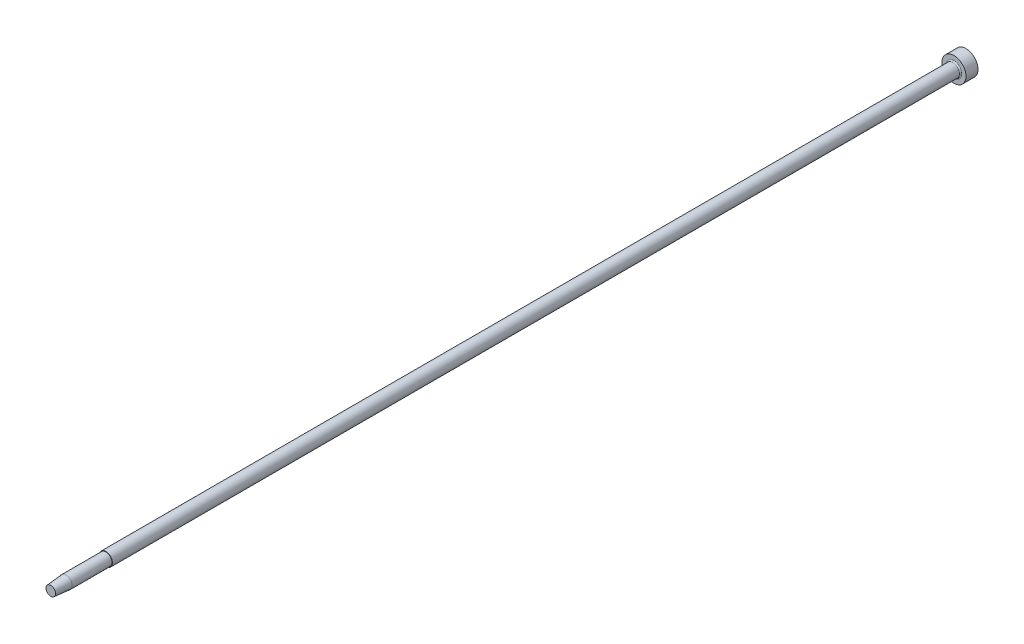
ISO-10303-21;
HEADER;
FILE_DESCRIPTION(('STEP AP214'),'2;1');
FILE_NAME('part.step','',(''),(''),'','','');
FILE_SCHEMA(('AUTOMOTIVE_DESIGN { 1 0 10303 214 1 1 1 1 }'));
ENDSEC;
DATA;
#1=APPLICATION_CONTEXT('core data for automotive mechanical design processes');
#2=APPLICATION_PROTOCOL_DEFINITION('international standard','automotive_design',2000,#1);
#3=PRODUCT_CONTEXT('',#1,'mechanical');
#4=PRODUCT('Part','Part','',(#3));
#5=PRODUCT_RELATED_PRODUCT_CATEGORY('part','',(#4));
#6=PRODUCT_DEFINITION_FORMATION('','',#4);
#7=PRODUCT_DEFINITION_CONTEXT('part definition',#1,'design');
#8=PRODUCT_DEFINITION('design','',#6,#7);
#9=PRODUCT_DEFINITION_SHAPE('','',#8);
#10=(LENGTH_UNIT() NAMED_UNIT(*) SI_UNIT(.MILLI.,.METRE.));
#11=(NAMED_UNIT(*) PLANE_ANGLE_UNIT() SI_UNIT($,.RADIAN.));
#12=(NAMED_UNIT(*) SI_UNIT($,.STERADIAN.) SOLID_ANGLE_UNIT());
#13=UNCERTAINTY_MEASURE_WITH_UNIT(LENGTH_MEASURE(1.E-05),#10,'distance_accuracy_value','');
#14=(GEOMETRIC_REPRESENTATION_CONTEXT(3) GLOBAL_UNCERTAINTY_ASSIGNED_CONTEXT((#13)) GLOBAL_UNIT_ASSIGNED_CONTEXT((#10,
#11,#12)) REPRESENTATION_CONTEXT('',''));
#15=CARTESIAN_POINT('',(0.,0.,0.));
#16=DIRECTION('',(0.,0.,1.));
#17=DIRECTION('',(1.,0.,0.));
#18=AXIS2_PLACEMENT_3D('',#15,#16,#17);
#19=CARTESIAN_POINT('',(0.,0.,2.));
#20=DIRECTION('',(0.,0.,1.));
#21=DIRECTION('',(1.,0.,0.));
#22=AXIS2_PLACEMENT_3D('',#19,#20,#21);
#23=PLANE('',#22);
#24=CARTESIAN_POINT('',(0.,0.,2.));
#25=DIRECTION('',(0.,0.,1.));
#26=DIRECTION('',(1.,0.,0.));
#27=AXIS2_PLACEMENT_3D('',#24,#25,#26);
#28=CIRCLE('',#27,1.3);
#29=CARTESIAN_POINT('',(1.3,0.,2.));
#30=VERTEX_POINT('',#29);
#31=EDGE_CURVE('E11',#30,#30,#28,.F.);
#32=ORIENTED_EDGE('',*,*,#31,.T.);
#33=EDGE_LOOP('',(#32));
#34=FACE_BOUND('',#33,.T.);
#35=CARTESIAN_POINT('',(0.,0.,2.));
#36=DIRECTION('',(0.,0.,1.));
#37=DIRECTION('',(1.,0.,0.));
#38=AXIS2_PLACEMENT_3D('',#35,#36,#37);
#39=CIRCLE('',#38,2.);
#40=CARTESIAN_POINT('',(2.,0.,2.));
#41=VERTEX_POINT('',#40);
#42=EDGE_CURVE('E41',#41,#41,#39,.T.);
#43=ORIENTED_EDGE('',*,*,#42,.T.);
#44=EDGE_LOOP('',(#43));
#45=FACE_BOUND('',#44,.T.);
#46=ADVANCED_FACE('F29',(#34,#45),#23,.T.);
#47=CARTESIAN_POINT('',(0.,0.,2.));
#48=DIRECTION('',(0.,0.,-1.));
#49=DIRECTION('',(-1.,0.,0.));
#50=AXIS2_PLACEMENT_3D('',#47,#48,#49);
#51=CYLINDRICAL_SURFACE('',#50,2.);
#52=ORIENTED_EDGE('',*,*,#42,.F.);
#53=EDGE_LOOP('',(#52));
#54=FACE_BOUND('',#53,.T.);
#55=CARTESIAN_POINT('',(0.,0.,0.));
#56=DIRECTION('',(0.,0.,1.));
#57=DIRECTION('',(1.,0.,0.));
#58=AXIS2_PLACEMENT_3D('',#55,#56,#57);
#59=CIRCLE('',#58,2.);
#60=CARTESIAN_POINT('',(2.,0.,0.));
#61=VERTEX_POINT('',#60);
#62=EDGE_CURVE('E46',#61,#61,#59,.T.);
#63=ORIENTED_EDGE('',*,*,#62,.T.);
#64=EDGE_LOOP('',(#63));
#65=FACE_BOUND('',#64,.T.);
#66=ADVANCED_FACE('F31',(#54,#65),#51,.T.);
#67=CARTESIAN_POINT('',(0.,0.,0.));
#68=DIRECTION('',(0.,0.,1.));
#69=DIRECTION('',(1.,0.,0.));
#70=AXIS2_PLACEMENT_3D('',#67,#68,#69);
#71=PLANE('',#70);
#72=ORIENTED_EDGE('',*,*,#62,.F.);
#73=EDGE_LOOP('',(#72));
#74=FACE_BOUND('',#73,.T.);
#75=ADVANCED_FACE('F80',(#74),#71,.F.);
#76=CARTESIAN_POINT('',(0.,0.,323.111269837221));
#77=DIRECTION('',(0.,0.,-1.));
#78=DIRECTION('',(-1.,0.,0.));
#79=AXIS2_PLACEMENT_3D('',#76,#77,#78);
#80=CYLINDRICAL_SURFACE('',#79,1.1);
#81=CARTESIAN_POINT('',(0.,0.,143.12425));
#82=DIRECTION('',(0.,0.,-1.));
#83=DIRECTION('',(0.,1.,0.));
#84=AXIS2_PLACEMENT_3D('',#81,#82,#83);
#85=CIRCLE('',#84,1.1);
#86=CARTESIAN_POINT('',(0.,1.1,143.12425));
#87=VERTEX_POINT('',#86);
#88=EDGE_CURVE('E33',#87,#87,#85,.T.);
#89=ORIENTED_EDGE('',*,*,#88,.T.);
#90=EDGE_LOOP('',(#89));
#91=FACE_BOUND('',#90,.T.);
#92=CARTESIAN_POINT('',(0.,0.,2.19999999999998));
#93=DIRECTION('',(0.,0.,1.));
#94=DIRECTION('',(1.,0.,0.));
#95=AXIS2_PLACEMENT_3D('',#92,#93,#94);
#96=CIRCLE('',#95,1.1);
#97=CARTESIAN_POINT('',(1.1,0.,2.19999999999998));
#98=VERTEX_POINT('',#97);
#99=EDGE_CURVE('E37',#98,#98,#96,.T.);
#100=ORIENTED_EDGE('',*,*,#99,.T.);
#101=EDGE_LOOP('',(#100));
#102=FACE_BOUND('',#101,.T.);
#103=ADVANCED_FACE('F86',(#91,#102),#80,.T.);
#104=CARTESIAN_POINT('',(0.,0.,2.19999999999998));
#105=DIRECTION('',(0.,0.,1.));
#106=DIRECTION('',(1.,0.,0.));
#107=AXIS2_PLACEMENT_3D('',#104,#105,#106);
#108=TOROIDAL_SURFACE('',#107,1.3,0.2);
#109=ORIENTED_EDGE('',*,*,#31,.F.);
#110=EDGE_LOOP('',(#109));
#111=FACE_BOUND('',#110,.T.);
#112=ORIENTED_EDGE('',*,*,#99,.F.);
#113=EDGE_LOOP('',(#112));
#114=FACE_BOUND('',#113,.T.);
#115=ADVANCED_FACE('F90',(#111,#114),#108,.F.);
#116=CARTESIAN_POINT('',(-1.14917760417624,24.5242222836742,143.12425));
#117=DIRECTION('',(0.,0.,-1.));
#118=DIRECTION('',(0.0675171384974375,-0.99771811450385,0.));
#119=AXIS2_PLACEMENT_3D('',#116,#117,#118);
#120=PLANE('',#119);
#121=CARTESIAN_POINT('',(0.,0.,143.12425));
#122=DIRECTION('',(0.,0.,-1.));
#123=DIRECTION('',(0.0675171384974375,-0.99771811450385,0.));
#124=AXIS2_PLACEMENT_3D('',#121,#122,#123);
#125=CIRCLE('',#124,1.0185);
#126=CARTESIAN_POINT('',(0.0687662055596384,-1.01617589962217,143.12425));
#127=VERTEX_POINT('',#126);
#128=EDGE_CURVE('E49',#127,#127,#125,.T.);
#129=ORIENTED_EDGE('',*,*,#128,.T.);
#130=EDGE_LOOP('',(#129));
#131=FACE_BOUND('',#130,.T.);
#132=ORIENTED_EDGE('',*,*,#88,.F.);
#133=EDGE_LOOP('',(#132));
#134=FACE_BOUND('',#133,.T.);
#135=ADVANCED_FACE('F73',(#131,#134),#120,.F.);
#136=CARTESIAN_POINT('',(0.,0.,157.208503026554));
#137=DIRECTION('',(0.,0.,-1.));
#138=DIRECTION('',(0.0675171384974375,-0.99771811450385,0.));
#139=AXIS2_PLACEMENT_3D('',#136,#137,#138);
#140=CYLINDRICAL_SURFACE('',#139,1.0185);
#141=CARTESIAN_POINT('',(0.,0.,149.7445));
#142=DIRECTION('',(0.,0.,-1.));
#143=DIRECTION('',(0.0675171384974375,-0.99771811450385,0.));
#144=AXIS2_PLACEMENT_3D('',#141,#142,#143);
#145=CIRCLE('',#144,1.0185);
#146=CARTESIAN_POINT('',(0.0687662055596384,-1.01617589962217,149.7445));
#147=VERTEX_POINT('',#146);
#148=EDGE_CURVE('E55',#147,#147,#145,.T.);
#149=ORIENTED_EDGE('',*,*,#148,.T.);
#150=EDGE_LOOP('',(#149));
#151=FACE_BOUND('',#150,.T.);
#152=ORIENTED_EDGE('',*,*,#128,.F.);
#153=EDGE_LOOP('',(#152));
#154=FACE_BOUND('',#153,.T.);
#155=ADVANCED_FACE('F59',(#151,#154),#140,.T.);
#156=CARTESIAN_POINT('',(0.,0.,149.7445));
#157=DIRECTION('',(0.,0.,-1.));
#158=DIRECTION('',(0.0675171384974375,-0.99771811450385,0.));
#159=AXIS2_PLACEMENT_3D('',#156,#157,#158);
#160=CONICAL_SURFACE('',#159,1.0185,0.0872664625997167);
#161=CARTESIAN_POINT('',(0.,0.,152.29075));
#162=DIRECTION('',(0.,0.,-1.));
#163=DIRECTION('',(0.0675171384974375,-0.99771811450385,0.));
#164=AXIS2_PLACEMENT_3D('',#161,#162,#163);
#165=CIRCLE('',#164,0.795731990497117);
#166=CARTESIAN_POINT('',(0.0537255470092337,-0.793916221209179,152.29075));
#167=VERTEX_POINT('',#166);
#168=EDGE_CURVE('E52',#167,#167,#165,.F.);
#169=ORIENTED_EDGE('',*,*,#168,.F.);
#170=EDGE_LOOP('',(#169));
#171=FACE_BOUND('',#170,.T.);
#172=ORIENTED_EDGE('',*,*,#148,.F.);
#173=EDGE_LOOP('',(#172));
#174=FACE_BOUND('',#173,.T.);
#175=ADVANCED_FACE('F62',(#171,#174),#160,.T.);
#176=CARTESIAN_POINT('',(-6.7426757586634,1.58537146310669,152.29075));
#177=DIRECTION('',(0.,0.,-1.));
#178=DIRECTION('',(0.0675171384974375,-0.99771811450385,0.));
#179=AXIS2_PLACEMENT_3D('',#176,#177,#178);
#180=PLANE('',#179);
#181=ORIENTED_EDGE('',*,*,#168,.T.);
#182=EDGE_LOOP('',(#181));
#183=FACE_BOUND('',#182,.T.);
#184=ADVANCED_FACE('F64',(#183),#180,.F.);
#185=CLOSED_SHELL('',(#46,#66,#75,#103,#115,#135,#155,#175,#184));
#186=MANIFOLD_SOLID_BREP('B2',#185);
#187=ADVANCED_BREP_SHAPE_REPRESENTATION('',(#18,#186),#14);
#188=SHAPE_DEFINITION_REPRESENTATION(#9,#187);
ENDSEC;
END-ISO-10303-21;
